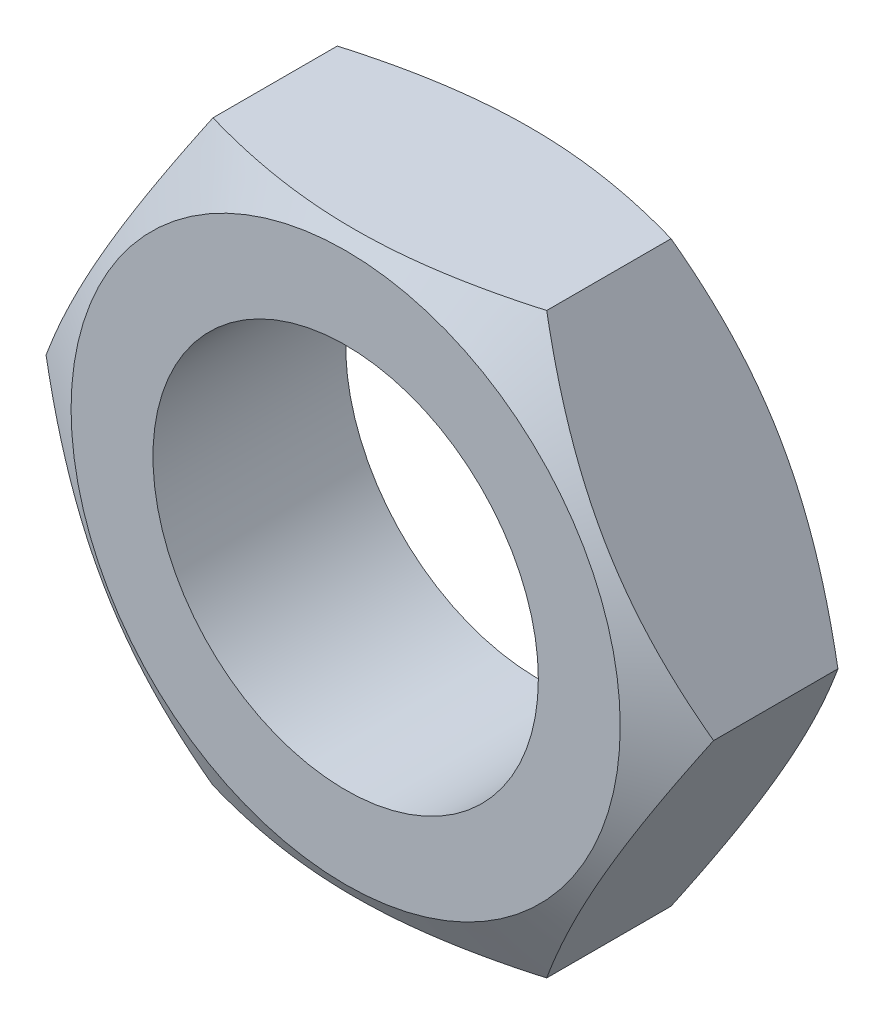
from build123d import *

# Parameters (mm, degrees)
BASENUTSKE_R            = 8
BASENUT_DEPTH           = 8
SKETCH6_OUTSIDE_W       = 109.962
SKETCH6_OUTSIDE_H       = 106.25
SKETCH6_OUTSIDE_R       = 11.4
CUT_EXTRUDE2_DEPTH      = 21
CUT_EXTRUDE2_DRAFT      = -60
MIRROR1_COPY_1_SKETCH_W = 109.962
MIRROR1_COPY_1_SKETCH_H = 106.25
MIRROR1_COPY_1_SKETCH_R = 11.4
MIRROR1_COPY_1_DEPTH    = 21
MIRROR1_COPY_1_DRAFT    = -60


with BuildPart() as part:
    # BaseNutSke → BaseNut (new body)
    with BuildSketch(Plane.XY):
        Polygon((6.92820323, -12), (-6.92820323, -12), (-13.856406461, 0), (-6.92820323, 12), (6.92820323, 12), (13.856406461, 0), align=None)
        Circle(BASENUTSKE_R, mode=Mode.SUBTRACT)
    extrude(amount=-BASENUT_DEPTH)


with BuildPart() as cut_extrude2_tool:
    # Sketch6 outside → Cut-Extrude2 (with draft: the straight prism first)
    with BuildSketch(Plane(origin=(0, 0, -8), x_dir=(-1, 0, 0), z_dir=(0, 0, -1))):
        Rectangle(SKETCH6_OUTSIDE_W, SKETCH6_OUTSIDE_H)
        Circle(SKETCH6_OUTSIDE_R, mode=Mode.SUBTRACT)
    extrude(amount=-CUT_EXTRUDE2_DEPTH)
    # Cut-Extrude2: the draft: its side faces are tilted about the plane it starts from
    cut_extrude2_sides = [cut_extrude2_tool.faces().sort_by_distance(p)[0] for p in [
        (0, -53.125, 2.5),
        (-54.981, 0, 2.5),
        (0, 53.125, 2.5),
        (54.981, 0, 2.5),
        (11.4, 0, 2.5),
    ]]
    draft(cut_extrude2_sides, Plane(origin=(0, 0, -8), x_dir=(-1, 0, 0), z_dir=(0, 0, -1)), CUT_EXTRUDE2_DRAFT)


with BuildPart() as part_1:
    add(part.part)

    # Cut-Extrude2: cut by cut_extrude2_tool
    add(cut_extrude2_tool.part, mode=Mode.SUBTRACT)


with BuildPart() as mirror1_copy_1_tool:
    # Mirror1 copy 1 sketch → Mirror1 copy 1 (with draft: the straight prism first)
    with BuildSketch(Plane(origin=(0, 0, 0), x_dir=(-1, 0, 0), z_dir=(0, 0, 1))):
        Rectangle(MIRROR1_COPY_1_SKETCH_W, MIRROR1_COPY_1_SKETCH_H)
        Circle(MIRROR1_COPY_1_SKETCH_R, mode=Mode.SUBTRACT)
    extrude(amount=-MIRROR1_COPY_1_DEPTH)
    # Mirror1 copy 1: the draft: its side faces are tilted about the plane it starts from
    mirror1_copy_1_sides = [mirror1_copy_1_tool.faces().sort_by_distance(p)[0] for p in [
        (0, -53.125, -10.5),
        (-54.981, 0, -10.5),
        (0, 53.125, -10.5),
        (54.981, 0, -10.5),
        (11.4, 0, -10.5),
    ]]
    draft(mirror1_copy_1_sides, Plane(origin=(0, 0, 0), x_dir=(-1, 0, 0), z_dir=(0, 0, 1)), MIRROR1_COPY_1_DRAFT)


with BuildPart() as part_2:
    add(part_1.part)

    # Mirror1 copy 1: cut by mirror1_copy_1_tool
    add(mirror1_copy_1_tool.part, mode=Mode.SUBTRACT)


solid = part_2.part
